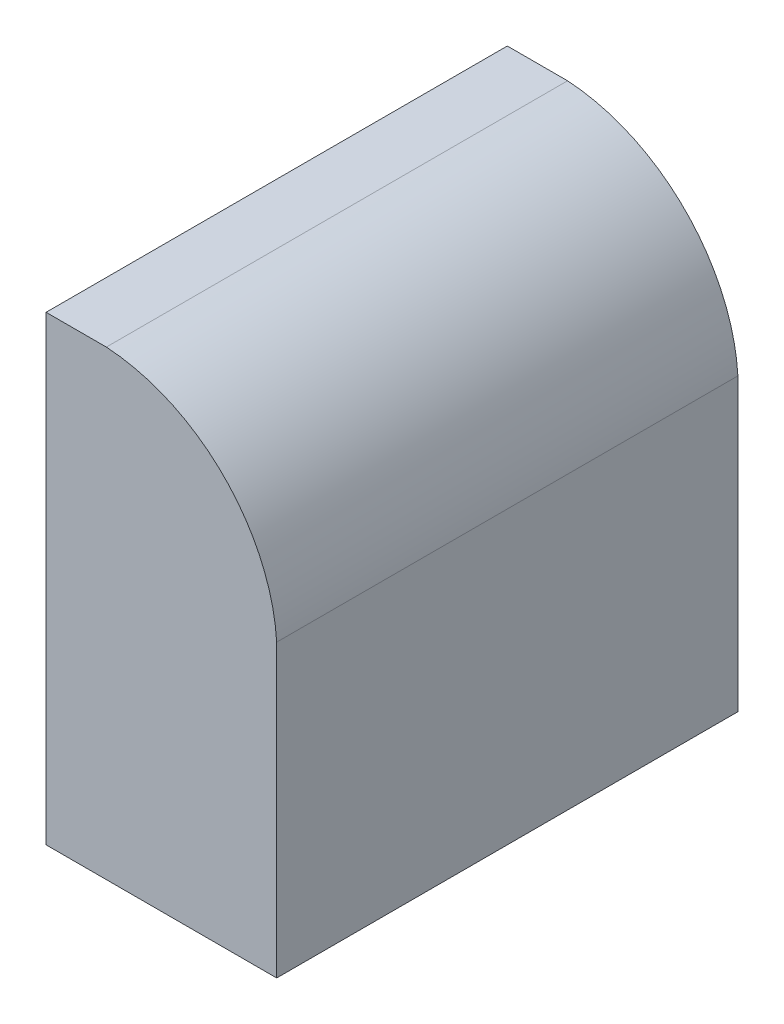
from build123d import *

# Parameters (mm, degrees)
BOSS_EXTRUDE1_DEPTH = 25.4
SKETCH2_R           = 1.8288
CUT_EXTRUDE1_DEPTH  = 12.7
SKETCH3_R           = 3.175
CUT_EXTRUDE2_DEPTH  = 3


with BuildPart() as part:
    # Sketch1 → Boss-Extrude1 (new body)
    with BuildSketch(Plane.XY):
        with BuildLine():
            Line((0, 0), (12.7, 0))
            Line((12.7, 0), (12.7, 16.018515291))
            ThreePointArc((12.7, 16.018515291), (9.78209225, 22.48209225), (3.318515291, 25.4))
            Line((3.318515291, 25.4), (0, 25.4))
            Line((0, 25.4), (0, 0))
        make_face()
    extrude(amount=BOSS_EXTRUDE1_DEPTH)

    # Sketch2 → Cut-Extrude1 (cut)
    with BuildSketch(Plane.XZ):
        with Locations(Location((6.35, 19.05, 0), (0, 0, 270))):
            Circle(SKETCH2_R)
        with Locations(Location((6.35, 6.35, 0), (0, 0, 270))):
            Circle(SKETCH2_R)
    extrude(amount=-CUT_EXTRUDE1_DEPTH, mode=Mode.SUBTRACT)

    # Sketch3 → Cut-Extrude2 (cut)
    with BuildSketch(Plane.ZY):
        with Locations((6.609281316, 18.862090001)):
            Circle(SKETCH3_R)
        with Locations((19.05, 19.118571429)):
            Circle(SKETCH3_R)
    extrude(amount=-CUT_EXTRUDE2_DEPTH, mode=Mode.SUBTRACT)


solid = part.part
